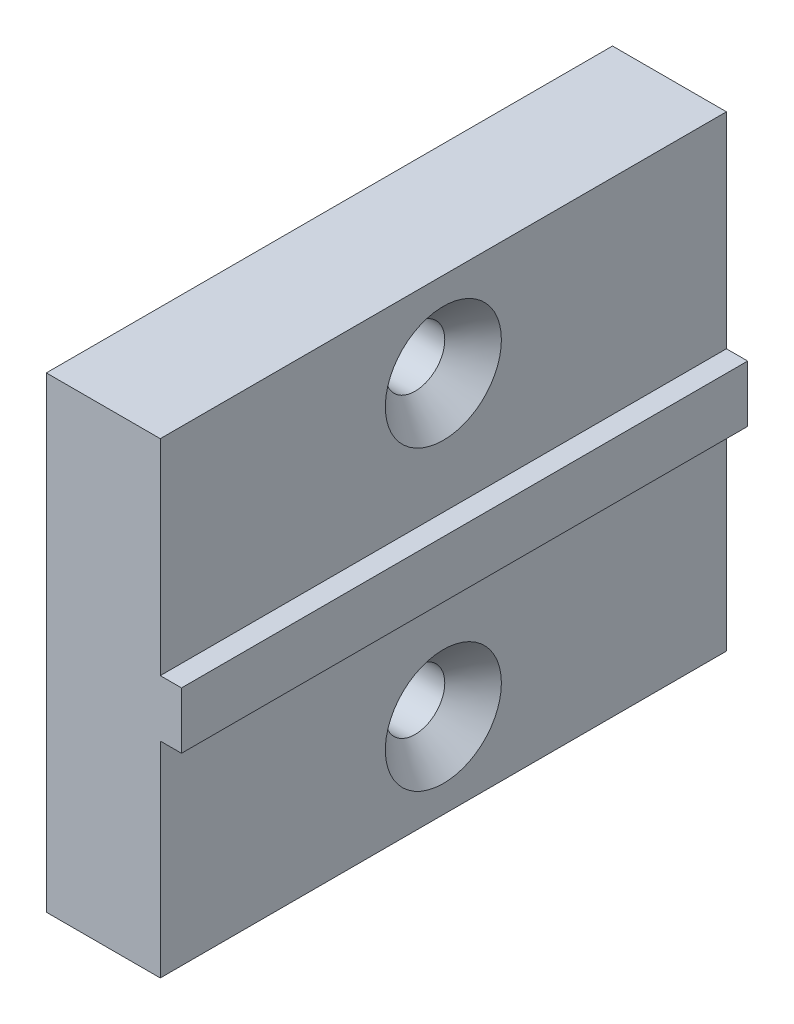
from build123d import *

# Parameters (mm, degrees)
ESQUISSE1_W                     = 40
ESQUISSE1_H                     = 33
BOSS_EXTRU_1_DEPTH              = 9.55
ESQUISSE2_W                     = 1.5
ESQUISSE2_H                     = 14.5
ENL_V_MAT_EXTRU_1_DEPTH         = 45.310862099
ESQUISSE3_W                     = 1.5
ESQUISSE3_H                     = 14.5
ENL_V_MAT_EXTRU_2_DEPTH         = 45.310862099
DIAM_TRE_DU_PER_AGE_4_2_4_2_1_D = 4.2
CHANFREIN1_SIZE                 = 2


with BuildPart() as part:
    # Esquisse1 → Boss.-Extru.1 (new body)
    with BuildSketch(Plane(origin=(9.55, 0, 0), x_dir=(0, 0, -1), z_dir=(1, 0, 0))):
        with Locations((20, 0)):
            Rectangle(ESQUISSE1_W, ESQUISSE1_H)
    extrude(amount=-BOSS_EXTRU_1_DEPTH)

    # Esquisse2 → Enl_v. mat.-Extru.1 (cut, through all)
    with BuildSketch(Plane(origin=(0, 0, -40), x_dir=(-1, 0, 0), z_dir=(0, 0, -1))):
        with Locations((-8.8, -9.25)):
            Rectangle(ESQUISSE2_W, ESQUISSE2_H)
    extrude(amount=-ENL_V_MAT_EXTRU_1_DEPTH, mode=Mode.SUBTRACT)

    # Esquisse3 → Enl_v. mat.-Extru.2 (cut, through all)
    with BuildSketch(Plane(origin=(0, 0, -40), x_dir=(-1, 0, 0), z_dir=(0, 0, -1))):
        with Locations((-8.8, 9.25)):
            Rectangle(ESQUISSE3_W, ESQUISSE3_H)
    extrude(amount=-ENL_V_MAT_EXTRU_2_DEPTH, mode=Mode.SUBTRACT)

    # Diam_tre du per_age _4.2 _4.2_1 (through all)
    with Locations(Plane(origin=(8.05, 0, 0), x_dir=(0, 0, -1), z_dir=(1, 0, 0))):
        with Locations((20, -10.5), (20, 10.5)):
            Hole(DIAM_TRE_DU_PER_AGE_4_2_4_2_1_D / 2)

    # Chanfrein1
    chanfrein1_edges = [part.edges().sort_by_distance(p)[0] for p in [
        (8.05, 10.5, -22.1),
        (8.05, -10.5, -22.1),
    ]]
    chamfer(chanfrein1_edges, length=CHANFREIN1_SIZE)


solid = part.part
